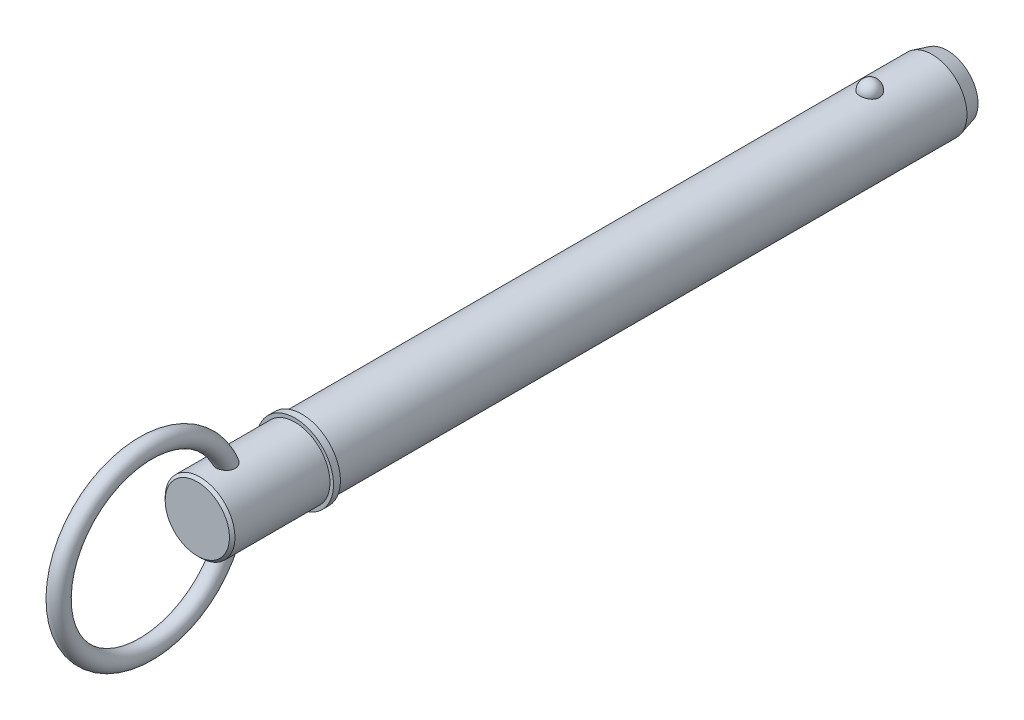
from build123d import *

# Parameters (mm, degrees)
SKETCH2_R           = 12.7
BOSS_EXTRUDE1_DEPTH = 203.2
BOSS_EXTRUDE2_START = 31.75
SKETCH3_R           = 12.7
BOSS_EXTRUDE2_DEPTH = 31.75
CHAMFER1_SIZE       = 5.5
CHAMFER1_SIZE2      = 1.473720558
SKETCH20_W          = 2.5
SKETCH20_H          = 14
SKETCH21_R          = 12.7
BOSS_EXTRUDE3_DEPTH = 38.1
CHAMFER2_SIZE       = 1
SKETCH24_R          = 3.25


with BuildPart() as part:
    # Sketch2 → Boss-Extrude1 (new body)
    with BuildSketch(Plane.XY):
        Circle(SKETCH2_R)
    extrude(amount=BOSS_EXTRUDE1_DEPTH)

    # Sketch3 → Boss-Extrude2 (add)
    with BuildSketch(Plane(origin=(0, 0, 0), x_dir=(-1, 0, 0), z_dir=(0, 0, -1)).offset(BOSS_EXTRUDE2_START)):
        Circle(SKETCH3_R)
    extrude(amount=-BOSS_EXTRUDE2_DEPTH)

    # Chamfer1
    chamfer1_edges = [part.edges().sort_by_distance(p)[0] for p in [
        (12.7, 0, -31.75),
    ]]
    chamfer1_side = [part.faces().sort_by_distance(p)[0] for p in [
        (12.7, 0, -15.875),
    ]]
    chamfer(chamfer1_edges, length=CHAMFER1_SIZE, length2=CHAMFER1_SIZE2, reference=chamfer1_side[0])

    # Sketch18 → Revolve1 (revolve)
    with BuildSketch(Plane(origin=(0, 0, 0), x_dir=(0, 0, -1), z_dir=(1, 0, 0))):
        with BuildLine():
            Line((3.56, 16.26), (3.56, 9.14))
            ThreePointArc((3.56, 9.14), (0, 12.7), (3.56, 16.26))
        make_face()
    revolve(axis=Axis((0, 16.26, -3.56), (0, -1, 0)))

    # Sketch20 → Revolve2 (revolve)
    with BuildSketch(Plane(origin=(0, 0, 0), x_dir=(0, 0, -1), z_dir=(1, 0, 0)), mode=Mode.PRIVATE) as revolve2_sk:
        with Locations((-204.45, 7)):
            Rectangle(SKETCH20_W, SKETCH20_H)
    revolve(revolve2_sk.sketch.rotate(Axis((0, 0, 33.728787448), (0, 0, 1)), 90), axis=Axis((0, 0, 33.728787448), (0, 0, 1)))

    # Sketch21 → Boss-Extrude3 (add)
    with BuildSketch(Plane(origin=(0, 0, 203.2), x_dir=(-1, 0, 0), z_dir=(0, 0, -1))):
        Circle(SKETCH21_R)
    extrude(amount=-BOSS_EXTRUDE3_DEPTH)

    # Chamfer2
    chamfer2_edges = [part.edges().sort_by_distance(p)[0] for p in [
        (12.7, 0, 241.3),
    ]]
    chamfer(chamfer2_edges, length=CHAMFER2_SIZE)

    # Sweep1: sweep along a path in Sketch23
    with BuildLine(Plane(origin=(0, 0, 0), x_dir=(0, 0, -1), z_dir=(1, 0, 0))) as sweep1_path:
        CenterArc((-260.05, 0), 31.75, 0, 360)
    # Sketch24 → Sweep1 (sweep)
    with BuildSketch(Plane(origin=(0, 0, 0), x_dir=(1, 0, 0), z_dir=(0, 1, 0))):
        with Locations((0, -228.3)):
            Circle(SKETCH24_R)
    sweep(path=sweep1_path.line)


solid = part.part
